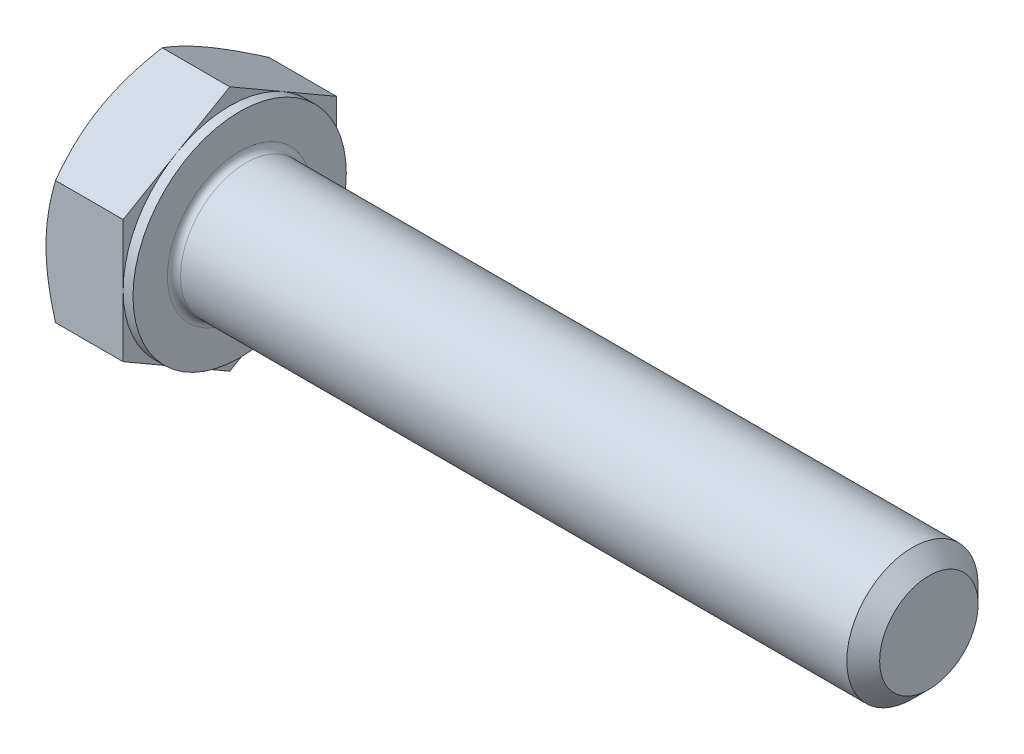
from build123d import *

# Parameters (mm, degrees)
EXTRUDE_358_DEPTH = 5.3
SKETCH_4_W        = 0.6
SKETCH_4_H        = 11.005553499
CHAMFER_1883_SIZE = 1
FILLET_1928_R     = 0.4


with BuildPart() as part:
    # Sketch 1 → Extrude 358 (new body)
    with BuildSketch(Plane(origin=(0, 0, 0), x_dir=(0, 0, -1), z_dir=(1, 0, 0))):
        Polygon((6.5, 3.75277675), (6.5, -3.75277675), (0, -7.505553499), (-6.5, -3.75277675), (-6.5, 3.75277675), (0, 7.505553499), align=None)
    extrude(amount=EXTRUDE_358_DEPTH)

    # Sketch 2 → Revolve 1 (revolve)
    with BuildSketch(Plane.XY, mode=Mode.PRIVATE) as revolve_1_sk:
        Polygon((0, 0), (47.3, 0), (47.3, 2.9175), (47.3, 4), (0, 4), align=None)
    revolve(revolve_1_sk.sketch.rotate(Axis((0, 0, 0), (1, 0, 0)), 90), axis=Axis((0, 0, 0), (1, 0, 0)))

    # Sketch 3 → Cut-Revolve 1 (revolve, cut)
    with BuildSketch(Plane.XY):
        Polygon((0, 6.5), (3.46730793, 12.505553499), (3.46730793, 17.505553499), (-10, 17.505553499), (-10, 6.5), align=None)
    revolve(axis=Axis((0, 0, 0), (1, 0, 0)), mode=Mode.SUBTRACT)

    # Sketch 5 → Cut-Revolve 2 (revolve, cut)
    with BuildSketch(Plane.XY):
        Polygon((5.3, 6.5), (1.83269207, 12.505553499), (1.83269207, 17.505553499), (11.83269207, 17.505553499), (11.83269207, 6.5), align=None)
    revolve(axis=Axis((0, 0, 0), (1, 0, 0)), mode=Mode.SUBTRACT)

    # Sketch 4 → Cut-Revolve 3 (revolve, cut)
    with BuildSketch(Plane.XY, mode=Mode.PRIVATE) as cut_revolve_3_sk:
        with Locations((5, 12.00277675)):
            Rectangle(SKETCH_4_W, SKETCH_4_H)
    revolve(cut_revolve_3_sk.sketch.rotate(Axis((0, 0, 0), (1, 0, 0)), 270), axis=Axis((0, 0, 0), (1, 0, 0)), mode=Mode.SUBTRACT)

    # Chamfer 1883
    chamfer_1883_edges = [part.edges().sort_by_distance(p)[0] for p in [
        (47.3, 0, -4),
    ]]
    chamfer(chamfer_1883_edges, length=CHAMFER_1883_SIZE)

    # Fillet 1928
    fillet_1928_edges = [part.edges().sort_by_distance(p)[0] for p in [
        (5.3, 0, -4),
    ]]
    fillet(fillet_1928_edges, radius=FILLET_1928_R)


solid = part.part
